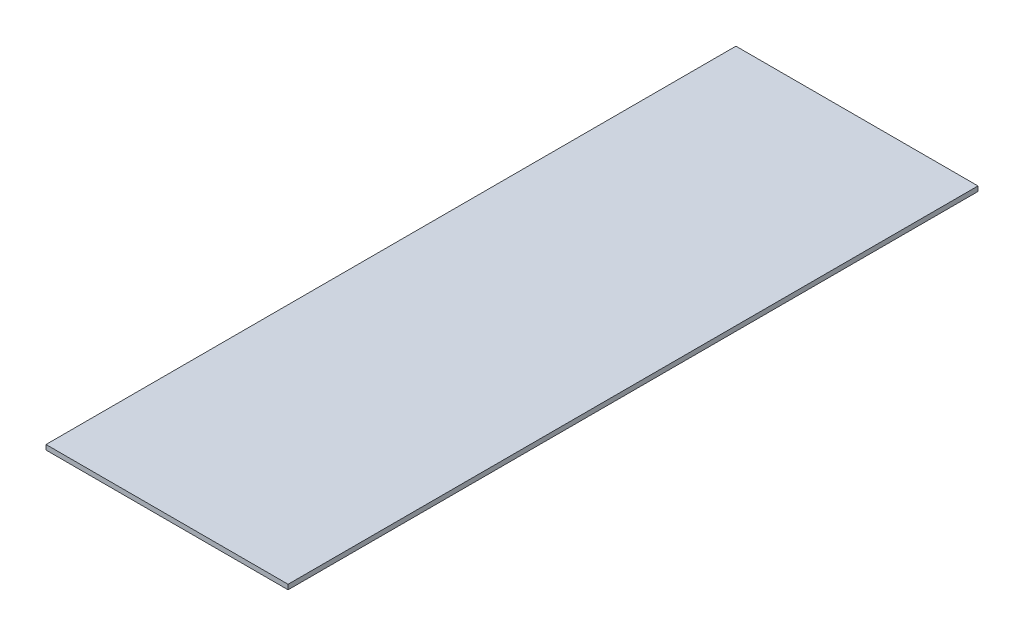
ISO-10303-21;
HEADER;
FILE_DESCRIPTION(('STEP AP214'),'2;1');
FILE_NAME('part.step','',(''),(''),'','','');
FILE_SCHEMA(('AUTOMOTIVE_DESIGN { 1 0 10303 214 1 1 1 1 }'));
ENDSEC;
DATA;
#1=APPLICATION_CONTEXT('core data for automotive mechanical design processes');
#2=APPLICATION_PROTOCOL_DEFINITION('international standard','automotive_design',2000,#1);
#3=PRODUCT_CONTEXT('',#1,'mechanical');
#4=PRODUCT('Part','Part','',(#3));
#5=PRODUCT_RELATED_PRODUCT_CATEGORY('part','',(#4));
#6=PRODUCT_DEFINITION_FORMATION('','',#4);
#7=PRODUCT_DEFINITION_CONTEXT('part definition',#1,'design');
#8=PRODUCT_DEFINITION('design','',#6,#7);
#9=PRODUCT_DEFINITION_SHAPE('','',#8);
#10=(LENGTH_UNIT() NAMED_UNIT(*) SI_UNIT(.MILLI.,.METRE.));
#11=(NAMED_UNIT(*) PLANE_ANGLE_UNIT() SI_UNIT($,.RADIAN.));
#12=(NAMED_UNIT(*) SI_UNIT($,.STERADIAN.) SOLID_ANGLE_UNIT());
#13=UNCERTAINTY_MEASURE_WITH_UNIT(LENGTH_MEASURE(1.E-05),#10,'distance_accuracy_value','');
#14=(GEOMETRIC_REPRESENTATION_CONTEXT(3) GLOBAL_UNCERTAINTY_ASSIGNED_CONTEXT((#13)) GLOBAL_UNIT_ASSIGNED_CONTEXT((#10,
#11,#12)) REPRESENTATION_CONTEXT('',''));
#15=CARTESIAN_POINT('',(0.,0.,0.));
#16=DIRECTION('',(0.,0.,1.));
#17=DIRECTION('',(1.,0.,0.));
#18=AXIS2_PLACEMENT_3D('',#15,#16,#17);
#19=CARTESIAN_POINT('',(63.5,2.54,180.975));
#20=DIRECTION('',(-1.,0.,0.));
#21=DIRECTION('',(0.,0.,1.));
#22=AXIS2_PLACEMENT_3D('',#19,#20,#21);
#23=PLANE('',#22);
#24=DIRECTION('',(0.,0.,-1.));
#25=VECTOR('',#24,1.);
#26=CARTESIAN_POINT('',(63.5,0.,180.975));
#27=LINE('',#26,#25);
#28=CARTESIAN_POINT('',(63.5,0.,180.975));
#29=VERTEX_POINT('',#28);
#30=CARTESIAN_POINT('',(63.5,0.,-180.975));
#31=VERTEX_POINT('',#30);
#32=EDGE_CURVE('E113',#29,#31,#27,.T.);
#33=ORIENTED_EDGE('',*,*,#32,.T.);
#34=DIRECTION('',(0.,-1.,0.));
#35=VECTOR('',#34,1.);
#36=CARTESIAN_POINT('',(63.5,2.54,-180.975));
#37=LINE('',#36,#35);
#38=CARTESIAN_POINT('',(63.5,2.54,-180.975));
#39=VERTEX_POINT('',#38);
#40=EDGE_CURVE('E11',#39,#31,#37,.T.);
#41=ORIENTED_EDGE('',*,*,#40,.F.);
#42=DIRECTION('',(0.,0.,-1.));
#43=VECTOR('',#42,1.);
#44=CARTESIAN_POINT('',(63.5,2.54,180.975));
#45=LINE('',#44,#43);
#46=CARTESIAN_POINT('',(63.5,2.54,180.975));
#47=VERTEX_POINT('',#46);
#48=EDGE_CURVE('E97',#47,#39,#45,.T.);
#49=ORIENTED_EDGE('',*,*,#48,.F.);
#50=DIRECTION('',(0.,-1.,0.));
#51=VECTOR('',#50,1.);
#52=CARTESIAN_POINT('',(63.5,2.54,180.975));
#53=LINE('',#52,#51);
#54=EDGE_CURVE('E109',#47,#29,#53,.T.);
#55=ORIENTED_EDGE('',*,*,#54,.T.);
#56=EDGE_LOOP('',(#33,#41,#49,#55));
#57=FACE_BOUND('',#56,.T.);
#58=ADVANCED_FACE('F45',(#57),#23,.F.);
#59=CARTESIAN_POINT('',(-63.5,2.54,-180.975));
#60=DIRECTION('',(0.,0.,1.));
#61=DIRECTION('',(1.,0.,0.));
#62=AXIS2_PLACEMENT_3D('',#59,#60,#61);
#63=PLANE('',#62);
#64=DIRECTION('',(-1.,0.,0.));
#65=VECTOR('',#64,1.);
#66=CARTESIAN_POINT('',(-63.5,0.,-180.975));
#67=LINE('',#66,#65);
#68=CARTESIAN_POINT('',(-63.5,0.,-180.975));
#69=VERTEX_POINT('',#68);
#70=EDGE_CURVE('E102',#31,#69,#67,.T.);
#71=ORIENTED_EDGE('',*,*,#70,.T.);
#72=DIRECTION('',(0.,-1.,0.));
#73=VECTOR('',#72,1.);
#74=CARTESIAN_POINT('',(-63.5,2.54,-180.975));
#75=LINE('',#74,#73);
#76=CARTESIAN_POINT('',(-63.5,2.54,-180.975));
#77=VERTEX_POINT('',#76);
#78=EDGE_CURVE('E54',#77,#69,#75,.T.);
#79=ORIENTED_EDGE('',*,*,#78,.F.);
#80=DIRECTION('',(-1.,0.,0.));
#81=VECTOR('',#80,1.);
#82=CARTESIAN_POINT('',(-63.5,2.54,-180.975));
#83=LINE('',#82,#81);
#84=EDGE_CURVE('E92',#39,#77,#83,.T.);
#85=ORIENTED_EDGE('',*,*,#84,.F.);
#86=ORIENTED_EDGE('',*,*,#40,.T.);
#87=EDGE_LOOP('',(#71,#79,#85,#86));
#88=FACE_BOUND('',#87,.T.);
#89=ADVANCED_FACE('F101',(#88),#63,.F.);
#90=CARTESIAN_POINT('',(-63.5,2.54,180.975));
#91=DIRECTION('',(1.,0.,0.));
#92=DIRECTION('',(0.,0.,-1.));
#93=AXIS2_PLACEMENT_3D('',#90,#91,#92);
#94=PLANE('',#93);
#95=DIRECTION('',(0.,0.,1.));
#96=VECTOR('',#95,1.);
#97=CARTESIAN_POINT('',(-63.5,0.,180.975));
#98=LINE('',#97,#96);
#99=CARTESIAN_POINT('',(-63.5,0.,180.975));
#100=VERTEX_POINT('',#99);
#101=EDGE_CURVE('E79',#69,#100,#98,.T.);
#102=ORIENTED_EDGE('',*,*,#101,.T.);
#103=DIRECTION('',(0.,-1.,0.));
#104=VECTOR('',#103,1.);
#105=CARTESIAN_POINT('',(-63.5,2.54,180.975));
#106=LINE('',#105,#104);
#107=CARTESIAN_POINT('',(-63.5,2.54,180.975));
#108=VERTEX_POINT('',#107);
#109=EDGE_CURVE('E104',#108,#100,#106,.T.);
#110=ORIENTED_EDGE('',*,*,#109,.F.);
#111=DIRECTION('',(0.,0.,1.));
#112=VECTOR('',#111,1.);
#113=CARTESIAN_POINT('',(-63.5,2.54,180.975));
#114=LINE('',#113,#112);
#115=EDGE_CURVE('E95',#77,#108,#114,.T.);
#116=ORIENTED_EDGE('',*,*,#115,.F.);
#117=ORIENTED_EDGE('',*,*,#78,.T.);
#118=EDGE_LOOP('',(#102,#110,#116,#117));
#119=FACE_BOUND('',#118,.T.);
#120=ADVANCED_FACE('F105',(#119),#94,.F.);
#121=CARTESIAN_POINT('',(-63.5,2.54,180.975));
#122=DIRECTION('',(0.,0.,-1.));
#123=DIRECTION('',(-1.,0.,0.));
#124=AXIS2_PLACEMENT_3D('',#121,#122,#123);
#125=PLANE('',#124);
#126=DIRECTION('',(1.,0.,0.));
#127=VECTOR('',#126,1.);
#128=CARTESIAN_POINT('',(-63.5,0.,180.975));
#129=LINE('',#128,#127);
#130=EDGE_CURVE('E85',#100,#29,#129,.T.);
#131=ORIENTED_EDGE('',*,*,#130,.T.);
#132=ORIENTED_EDGE('',*,*,#54,.F.);
#133=DIRECTION('',(1.,0.,0.));
#134=VECTOR('',#133,1.);
#135=CARTESIAN_POINT('',(-63.5,2.54,180.975));
#136=LINE('',#135,#134);
#137=EDGE_CURVE('E62',#108,#47,#136,.T.);
#138=ORIENTED_EDGE('',*,*,#137,.F.);
#139=ORIENTED_EDGE('',*,*,#109,.T.);
#140=EDGE_LOOP('',(#131,#132,#138,#139));
#141=FACE_BOUND('',#140,.T.);
#142=ADVANCED_FACE('F126',(#141),#125,.F.);
#143=CARTESIAN_POINT('',(0.,2.54,0.));
#144=DIRECTION('',(0.,-1.,0.));
#145=DIRECTION('',(0.,0.,-1.));
#146=AXIS2_PLACEMENT_3D('',#143,#144,#145);
#147=PLANE('',#146);
#148=ORIENTED_EDGE('',*,*,#48,.T.);
#149=ORIENTED_EDGE('',*,*,#84,.T.);
#150=ORIENTED_EDGE('',*,*,#115,.T.);
#151=ORIENTED_EDGE('',*,*,#137,.T.);
#152=EDGE_LOOP('',(#148,#149,#150,#151));
#153=FACE_BOUND('',#152,.T.);
#154=ADVANCED_FACE('F93',(#153),#147,.F.);
#155=CARTESIAN_POINT('',(0.,0.,0.));
#156=DIRECTION('',(0.,-1.,0.));
#157=DIRECTION('',(0.,0.,-1.));
#158=AXIS2_PLACEMENT_3D('',#155,#156,#157);
#159=PLANE('',#158);
#160=ORIENTED_EDGE('',*,*,#32,.F.);
#161=ORIENTED_EDGE('',*,*,#130,.F.);
#162=ORIENTED_EDGE('',*,*,#101,.F.);
#163=ORIENTED_EDGE('',*,*,#70,.F.);
#164=EDGE_LOOP('',(#160,#161,#162,#163));
#165=FACE_BOUND('',#164,.T.);
#166=ADVANCED_FACE('F129',(#165),#159,.T.);
#167=CLOSED_SHELL('',(#58,#89,#120,#142,#154,#166));
#168=MANIFOLD_SOLID_BREP('B2',#167);
#169=ADVANCED_BREP_SHAPE_REPRESENTATION('',(#18,#168),#14);
#170=SHAPE_DEFINITION_REPRESENTATION(#9,#169);
ENDSEC;
END-ISO-10303-21;
